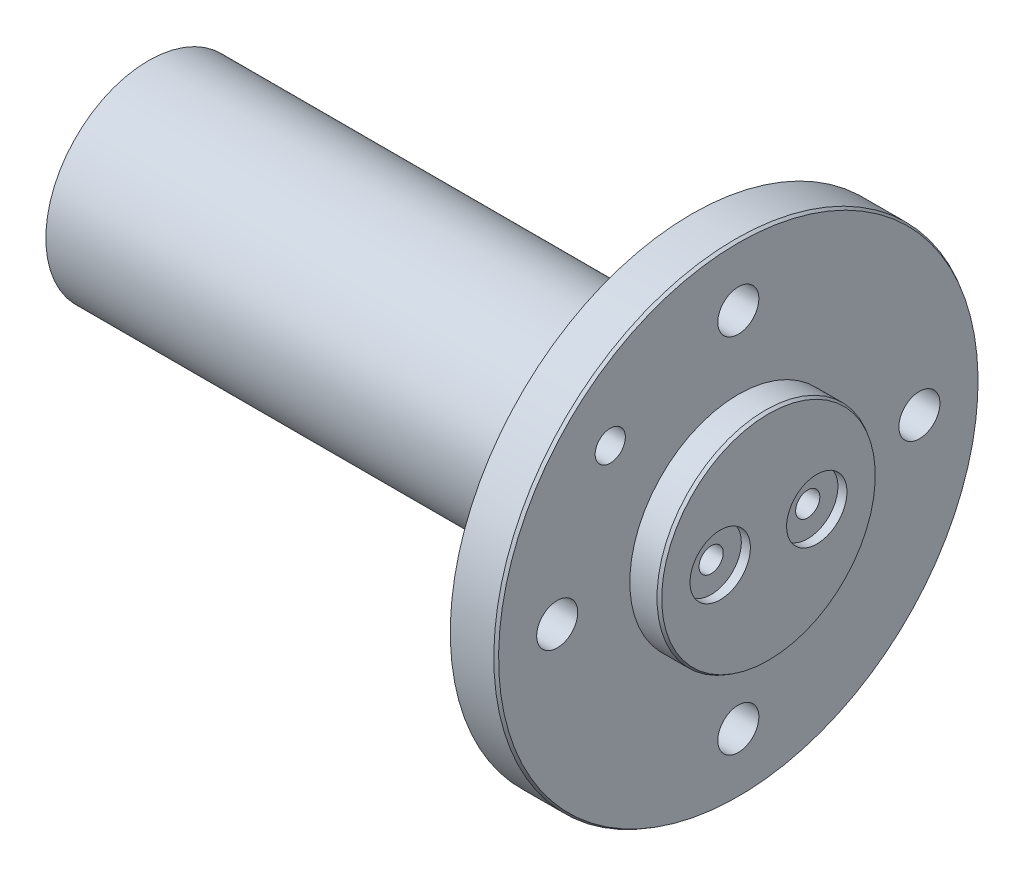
ISO-10303-21;
HEADER;
FILE_DESCRIPTION(('STEP AP214'),'2;1');
FILE_NAME('part.step','',(''),(''),'','','');
FILE_SCHEMA(('AUTOMOTIVE_DESIGN { 1 0 10303 214 1 1 1 1 }'));
ENDSEC;
DATA;
#1=APPLICATION_CONTEXT('core data for automotive mechanical design processes');
#2=APPLICATION_PROTOCOL_DEFINITION('international standard','automotive_design',2000,#1);
#3=PRODUCT_CONTEXT('',#1,'mechanical');
#4=PRODUCT('Part','Part','',(#3));
#5=PRODUCT_RELATED_PRODUCT_CATEGORY('part','',(#4));
#6=PRODUCT_DEFINITION_FORMATION('','',#4);
#7=PRODUCT_DEFINITION_CONTEXT('part definition',#1,'design');
#8=PRODUCT_DEFINITION('design','',#6,#7);
#9=PRODUCT_DEFINITION_SHAPE('','',#8);
#10=(LENGTH_UNIT() NAMED_UNIT(*) SI_UNIT(.MILLI.,.METRE.));
#11=(NAMED_UNIT(*) PLANE_ANGLE_UNIT() SI_UNIT($,.RADIAN.));
#12=(NAMED_UNIT(*) SI_UNIT($,.STERADIAN.) SOLID_ANGLE_UNIT());
#13=UNCERTAINTY_MEASURE_WITH_UNIT(LENGTH_MEASURE(1.E-05),#10,'distance_accuracy_value','');
#14=(GEOMETRIC_REPRESENTATION_CONTEXT(3) GLOBAL_UNCERTAINTY_ASSIGNED_CONTEXT((#13)) GLOBAL_UNIT_ASSIGNED_CONTEXT((#10,
#11,#12)) REPRESENTATION_CONTEXT('',''));
#15=CARTESIAN_POINT('',(0.,0.,0.));
#16=DIRECTION('',(0.,0.,1.));
#17=DIRECTION('',(1.,0.,0.));
#18=AXIS2_PLACEMENT_3D('',#15,#16,#17);
#19=CARTESIAN_POINT('',(0.,0.,0.));
#20=DIRECTION('',(1.,0.,0.));
#21=DIRECTION('',(0.,1.,0.));
#22=AXIS2_PLACEMENT_3D('',#19,#20,#21);
#23=PLANE('',#22);
#24=CARTESIAN_POINT('',(0.,0.,0.));
#25=DIRECTION('',(1.,0.,0.));
#26=DIRECTION('',(0.,1.,0.));
#27=AXIS2_PLACEMENT_3D('',#24,#25,#26);
#28=CIRCLE('',#27,17.6863248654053);
#29=CARTESIAN_POINT('',(0.,17.6863248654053,0.));
#30=VERTEX_POINT('',#29);
#31=EDGE_CURVE('E29',#30,#30,#28,.T.);
#32=ORIENTED_EDGE('',*,*,#31,.T.);
#33=EDGE_LOOP('',(#32));
#34=FACE_BOUND('',#33,.T.);
#35=CARTESIAN_POINT('',(0.,0.,8.));
#36=DIRECTION('',(1.,0.,0.));
#37=DIRECTION('',(0.,1.,0.));
#38=AXIS2_PLACEMENT_3D('',#35,#36,#37);
#39=CIRCLE('',#38,5.);
#40=CARTESIAN_POINT('',(0.,5.,8.));
#41=VERTEX_POINT('',#40);
#42=EDGE_CURVE('E84',#41,#41,#39,.T.);
#43=ORIENTED_EDGE('',*,*,#42,.F.);
#44=EDGE_LOOP('',(#43));
#45=FACE_BOUND('',#44,.T.);
#46=CARTESIAN_POINT('',(0.,0.,-8.));
#47=DIRECTION('',(1.,0.,0.));
#48=DIRECTION('',(0.,1.,0.));
#49=AXIS2_PLACEMENT_3D('',#46,#47,#48);
#50=CIRCLE('',#49,5.);
#51=CARTESIAN_POINT('',(0.,5.,-8.));
#52=VERTEX_POINT('',#51);
#53=EDGE_CURVE('E50',#52,#52,#50,.T.);
#54=ORIENTED_EDGE('',*,*,#53,.F.);
#55=EDGE_LOOP('',(#54));
#56=FACE_BOUND('',#55,.T.);
#57=ADVANCED_FACE('F14',(#34,#45,#56),#23,.T.);
#58=CARTESIAN_POINT('',(0.,0.,0.));
#59=DIRECTION('',(1.,0.,0.));
#60=DIRECTION('',(0.,1.,0.));
#61=AXIS2_PLACEMENT_3D('',#58,#59,#60);
#62=CYLINDRICAL_SURFACE('',#61,17.975);
#63=CARTESIAN_POINT('',(-0.499999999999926,0.,0.));
#64=DIRECTION('',(1.,0.,0.));
#65=DIRECTION('',(0.,1.,0.));
#66=AXIS2_PLACEMENT_3D('',#63,#64,#65);
#67=CIRCLE('',#66,17.975);
#68=CARTESIAN_POINT('',(-0.499999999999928,17.975,0.));
#69=VERTEX_POINT('',#68);
#70=EDGE_CURVE('E25',#69,#69,#67,.F.);
#71=ORIENTED_EDGE('',*,*,#70,.T.);
#72=EDGE_LOOP('',(#71));
#73=FACE_BOUND('',#72,.T.);
#74=CARTESIAN_POINT('',(-5.,0.,0.));
#75=DIRECTION('',(1.,0.,0.));
#76=DIRECTION('',(0.,1.,0.));
#77=AXIS2_PLACEMENT_3D('',#74,#75,#76);
#78=CIRCLE('',#77,17.975);
#79=CARTESIAN_POINT('',(-5.,17.975,0.));
#80=VERTEX_POINT('',#79);
#81=EDGE_CURVE('E46',#80,#80,#78,.T.);
#82=ORIENTED_EDGE('',*,*,#81,.T.);
#83=EDGE_LOOP('',(#82));
#84=FACE_BOUND('',#83,.T.);
#85=ADVANCED_FACE('F120',(#73,#84),#62,.T.);
#86=CARTESIAN_POINT('',(-5.,17.975,0.));
#87=DIRECTION('',(1.,0.,0.));
#88=DIRECTION('',(0.,1.,0.));
#89=AXIS2_PLACEMENT_3D('',#86,#87,#88);
#90=PLANE('',#89);
#91=CARTESIAN_POINT('',(-5.,0.,0.));
#92=DIRECTION('',(1.,0.,0.));
#93=DIRECTION('',(0.,1.,0.));
#94=AXIS2_PLACEMENT_3D('',#91,#92,#93);
#95=CIRCLE('',#94,39.7113248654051);
#96=CARTESIAN_POINT('',(-5.00000000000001,39.7113248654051,0.));
#97=VERTEX_POINT('',#96);
#98=EDGE_CURVE('E34',#97,#97,#95,.T.);
#99=ORIENTED_EDGE('',*,*,#98,.T.);
#100=EDGE_LOOP('',(#99));
#101=FACE_BOUND('',#100,.T.);
#102=CARTESIAN_POINT('',(-5.,21.2132034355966,21.2132034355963));
#103=DIRECTION('',(1.,0.,0.));
#104=DIRECTION('',(0.,1.,0.));
#105=AXIS2_PLACEMENT_3D('',#102,#103,#104);
#106=CIRCLE('',#105,2.5);
#107=CARTESIAN_POINT('',(-5.,23.7132034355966,21.2132034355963));
#108=VERTEX_POINT('',#107);
#109=EDGE_CURVE('E101',#108,#108,#106,.T.);
#110=ORIENTED_EDGE('',*,*,#109,.F.);
#111=EDGE_LOOP('',(#110));
#112=FACE_BOUND('',#111,.T.);
#113=CARTESIAN_POINT('',(-5.,30.,0.));
#114=DIRECTION('',(1.,0.,0.));
#115=DIRECTION('',(0.,1.,0.));
#116=AXIS2_PLACEMENT_3D('',#113,#114,#115);
#117=CIRCLE('',#116,3.4);
#118=CARTESIAN_POINT('',(-5.,33.4,0.));
#119=VERTEX_POINT('',#118);
#120=EDGE_CURVE('E60',#119,#119,#117,.T.);
#121=ORIENTED_EDGE('',*,*,#120,.F.);
#122=EDGE_LOOP('',(#121));
#123=FACE_BOUND('',#122,.T.);
#124=CARTESIAN_POINT('',(-5.,0.,30.));
#125=DIRECTION('',(1.,0.,0.));
#126=DIRECTION('',(0.,1.,0.));
#127=AXIS2_PLACEMENT_3D('',#124,#125,#126);
#128=CIRCLE('',#127,3.4);
#129=CARTESIAN_POINT('',(-5.,3.4,30.));
#130=VERTEX_POINT('',#129);
#131=EDGE_CURVE('E96',#130,#130,#128,.T.);
#132=ORIENTED_EDGE('',*,*,#131,.F.);
#133=EDGE_LOOP('',(#132));
#134=FACE_BOUND('',#133,.T.);
#135=CARTESIAN_POINT('',(-5.,-30.,0.));
#136=DIRECTION('',(1.,0.,0.));
#137=DIRECTION('',(0.,1.,0.));
#138=AXIS2_PLACEMENT_3D('',#135,#136,#137);
#139=CIRCLE('',#138,3.4);
#140=CARTESIAN_POINT('',(-5.,-26.6,0.));
#141=VERTEX_POINT('',#140);
#142=EDGE_CURVE('E92',#141,#141,#139,.T.);
#143=ORIENTED_EDGE('',*,*,#142,.F.);
#144=EDGE_LOOP('',(#143));
#145=FACE_BOUND('',#144,.T.);
#146=CARTESIAN_POINT('',(-5.,0.,-30.));
#147=DIRECTION('',(1.,0.,0.));
#148=DIRECTION('',(0.,1.,0.));
#149=AXIS2_PLACEMENT_3D('',#146,#147,#148);
#150=CIRCLE('',#149,3.4);
#151=CARTESIAN_POINT('',(-5.,3.4,-30.));
#152=VERTEX_POINT('',#151);
#153=EDGE_CURVE('E89',#152,#152,#150,.T.);
#154=ORIENTED_EDGE('',*,*,#153,.F.);
#155=EDGE_LOOP('',(#154));
#156=FACE_BOUND('',#155,.T.);
#157=ORIENTED_EDGE('',*,*,#81,.F.);
#158=EDGE_LOOP('',(#157));
#159=FACE_BOUND('',#158,.T.);
#160=ADVANCED_FACE('F116',(#101,#112,#123,#134,#145,#156,#159),#90,.T.);
#161=CARTESIAN_POINT('',(0.,0.,0.));
#162=DIRECTION('',(1.,0.,0.));
#163=DIRECTION('',(0.,1.,0.));
#164=AXIS2_PLACEMENT_3D('',#161,#162,#163);
#165=CYLINDRICAL_SURFACE('',#164,40.);
#166=CARTESIAN_POINT('',(-12.7113248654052,0.,0.));
#167=DIRECTION('',(-1.,0.,0.));
#168=DIRECTION('',(0.,-1.,0.));
#169=AXIS2_PLACEMENT_3D('',#166,#167,#168);
#170=CIRCLE('',#169,40.);
#171=CARTESIAN_POINT('',(-12.7113248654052,-40.,0.));
#172=VERTEX_POINT('',#171);
#173=EDGE_CURVE('E40',#172,#172,#170,.F.);
#174=ORIENTED_EDGE('',*,*,#173,.T.);
#175=EDGE_LOOP('',(#174));
#176=FACE_BOUND('',#175,.T.);
#177=CARTESIAN_POINT('',(-5.5,0.,0.));
#178=DIRECTION('',(1.,0.,0.));
#179=DIRECTION('',(0.,1.,0.));
#180=AXIS2_PLACEMENT_3D('',#177,#178,#179);
#181=CIRCLE('',#180,40.);
#182=CARTESIAN_POINT('',(-5.50000000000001,40.,0.));
#183=VERTEX_POINT('',#182);
#184=EDGE_CURVE('E43',#183,#183,#181,.F.);
#185=ORIENTED_EDGE('',*,*,#184,.T.);
#186=EDGE_LOOP('',(#185));
#187=FACE_BOUND('',#186,.T.);
#188=ADVANCED_FACE('F119',(#176,#187),#165,.T.);
#189=CARTESIAN_POINT('',(-13.,40.,0.));
#190=DIRECTION('',(-1.,0.,0.));
#191=DIRECTION('',(0.,-1.,0.));
#192=AXIS2_PLACEMENT_3D('',#189,#190,#191);
#193=PLANE('',#192);
#194=CARTESIAN_POINT('',(-13.,0.,0.));
#195=DIRECTION('',(-1.,0.,0.));
#196=DIRECTION('',(0.,-1.,0.));
#197=AXIS2_PLACEMENT_3D('',#194,#195,#196);
#198=CIRCLE('',#197,39.5);
#199=CARTESIAN_POINT('',(-13.,-39.5,0.));
#200=VERTEX_POINT('',#199);
#201=EDGE_CURVE('E37',#200,#200,#198,.T.);
#202=ORIENTED_EDGE('',*,*,#201,.T.);
#203=EDGE_LOOP('',(#202));
#204=FACE_BOUND('',#203,.T.);
#205=CARTESIAN_POINT('',(-13.,30.,0.));
#206=DIRECTION('',(-1.,0.,0.));
#207=DIRECTION('',(0.,-1.,0.));
#208=AXIS2_PLACEMENT_3D('',#205,#206,#207);
#209=CIRCLE('',#208,3.4);
#210=CARTESIAN_POINT('',(-13.,26.6,0.));
#211=VERTEX_POINT('',#210);
#212=EDGE_CURVE('E47',#211,#211,#209,.T.);
#213=ORIENTED_EDGE('',*,*,#212,.F.);
#214=EDGE_LOOP('',(#213));
#215=FACE_BOUND('',#214,.T.);
#216=CARTESIAN_POINT('',(-13.,0.,30.));
#217=DIRECTION('',(-1.,0.,0.));
#218=DIRECTION('',(0.,-1.,0.));
#219=AXIS2_PLACEMENT_3D('',#216,#217,#218);
#220=CIRCLE('',#219,3.4);
#221=CARTESIAN_POINT('',(-13.,-3.4,30.));
#222=VERTEX_POINT('',#221);
#223=EDGE_CURVE('E51',#222,#222,#220,.T.);
#224=ORIENTED_EDGE('',*,*,#223,.F.);
#225=EDGE_LOOP('',(#224));
#226=FACE_BOUND('',#225,.T.);
#227=CARTESIAN_POINT('',(-13.,-30.,0.));
#228=DIRECTION('',(-1.,0.,0.));
#229=DIRECTION('',(0.,-1.,0.));
#230=AXIS2_PLACEMENT_3D('',#227,#228,#229);
#231=CIRCLE('',#230,3.4);
#232=CARTESIAN_POINT('',(-13.,-33.4,0.));
#233=VERTEX_POINT('',#232);
#234=EDGE_CURVE('E54',#233,#233,#231,.T.);
#235=ORIENTED_EDGE('',*,*,#234,.F.);
#236=EDGE_LOOP('',(#235));
#237=FACE_BOUND('',#236,.T.);
#238=CARTESIAN_POINT('',(-13.,0.,-30.));
#239=DIRECTION('',(-1.,0.,0.));
#240=DIRECTION('',(0.,-1.,0.));
#241=AXIS2_PLACEMENT_3D('',#238,#239,#240);
#242=CIRCLE('',#241,3.4);
#243=CARTESIAN_POINT('',(-13.,-3.4,-30.));
#244=VERTEX_POINT('',#243);
#245=EDGE_CURVE('E57',#244,#244,#242,.T.);
#246=ORIENTED_EDGE('',*,*,#245,.F.);
#247=EDGE_LOOP('',(#246));
#248=FACE_BOUND('',#247,.T.);
#249=CARTESIAN_POINT('',(-13.,0.,0.));
#250=DIRECTION('',(1.,0.,0.));
#251=DIRECTION('',(0.,1.,0.));
#252=AXIS2_PLACEMENT_3D('',#249,#250,#251);
#253=CIRCLE('',#252,17.);
#254=CARTESIAN_POINT('',(-13.,17.,0.));
#255=VERTEX_POINT('',#254);
#256=EDGE_CURVE('E71',#255,#255,#253,.T.);
#257=ORIENTED_EDGE('',*,*,#256,.T.);
#258=EDGE_LOOP('',(#257));
#259=FACE_BOUND('',#258,.T.);
#260=ADVANCED_FACE('F207',(#204,#215,#226,#237,#248,#259),#193,.T.);
#261=CARTESIAN_POINT('',(0.,0.,0.));
#262=DIRECTION('',(1.,0.,0.));
#263=DIRECTION('',(0.,1.,0.));
#264=AXIS2_PLACEMENT_3D('',#261,#262,#263);
#265=CYLINDRICAL_SURFACE('',#264,17.);
#266=CARTESIAN_POINT('',(-102.711324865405,0.,0.));
#267=DIRECTION('',(-1.,0.,0.));
#268=DIRECTION('',(0.,-1.,0.));
#269=AXIS2_PLACEMENT_3D('',#266,#267,#268);
#270=CIRCLE('',#269,17.);
#271=CARTESIAN_POINT('',(-102.711324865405,-17.,0.));
#272=VERTEX_POINT('',#271);
#273=EDGE_CURVE('E21',#272,#272,#270,.F.);
#274=ORIENTED_EDGE('',*,*,#273,.T.);
#275=EDGE_LOOP('',(#274));
#276=FACE_BOUND('',#275,.T.);
#277=ORIENTED_EDGE('',*,*,#256,.F.);
#278=EDGE_LOOP('',(#277));
#279=FACE_BOUND('',#278,.T.);
#280=ADVANCED_FACE('F204',(#276,#279),#265,.T.);
#281=CARTESIAN_POINT('',(-103.,17.,0.));
#282=DIRECTION('',(-1.,0.,0.));
#283=DIRECTION('',(0.,-1.,0.));
#284=AXIS2_PLACEMENT_3D('',#281,#282,#283);
#285=PLANE('',#284);
#286=CARTESIAN_POINT('',(-103.,0.,0.));
#287=DIRECTION('',(-1.,0.,0.));
#288=DIRECTION('',(0.,-1.,0.));
#289=AXIS2_PLACEMENT_3D('',#286,#287,#288);
#290=CIRCLE('',#289,16.5);
#291=CARTESIAN_POINT('',(-103.,-16.5,0.));
#292=VERTEX_POINT('',#291);
#293=EDGE_CURVE('E9',#292,#292,#290,.T.);
#294=ORIENTED_EDGE('',*,*,#293,.T.);
#295=EDGE_LOOP('',(#294));
#296=FACE_BOUND('',#295,.T.);
#297=ADVANCED_FACE('F200',(#296),#285,.T.);
#298=CARTESIAN_POINT('',(-1.5,0.,8.));
#299=DIRECTION('',(1.,0.,0.));
#300=DIRECTION('',(0.,1.,0.));
#301=AXIS2_PLACEMENT_3D('',#298,#299,#300);
#302=PLANE('',#301);
#303=CARTESIAN_POINT('',(-1.5,0.,8.));
#304=DIRECTION('',(1.,0.,0.));
#305=DIRECTION('',(0.,1.,0.));
#306=AXIS2_PLACEMENT_3D('',#303,#304,#305);
#307=CIRCLE('',#306,5.);
#308=CARTESIAN_POINT('',(-1.5,5.,8.));
#309=VERTEX_POINT('',#308);
#310=EDGE_CURVE('E68',#309,#309,#307,.T.);
#311=ORIENTED_EDGE('',*,*,#310,.T.);
#312=EDGE_LOOP('',(#311));
#313=FACE_BOUND('',#312,.T.);
#314=CARTESIAN_POINT('',(-1.5,0.,8.));
#315=DIRECTION('',(1.,0.,0.));
#316=DIRECTION('',(0.,1.,0.));
#317=AXIS2_PLACEMENT_3D('',#314,#315,#316);
#318=CIRCLE('',#317,2.);
#319=CARTESIAN_POINT('',(-1.5,2.,8.));
#320=VERTEX_POINT('',#319);
#321=EDGE_CURVE('E65',#320,#320,#318,.F.);
#322=ORIENTED_EDGE('',*,*,#321,.T.);
#323=EDGE_LOOP('',(#322));
#324=FACE_BOUND('',#323,.T.);
#325=ADVANCED_FACE('F203',(#313,#324),#302,.T.);
#326=CARTESIAN_POINT('',(-1.5,0.,8.));
#327=DIRECTION('',(1.,0.,0.));
#328=DIRECTION('',(0.,1.,0.));
#329=AXIS2_PLACEMENT_3D('',#326,#327,#328);
#330=CYLINDRICAL_SURFACE('',#329,5.);
#331=ORIENTED_EDGE('',*,*,#310,.F.);
#332=EDGE_LOOP('',(#331));
#333=FACE_BOUND('',#332,.T.);
#334=ORIENTED_EDGE('',*,*,#42,.T.);
#335=EDGE_LOOP('',(#334));
#336=FACE_BOUND('',#335,.T.);
#337=ADVANCED_FACE('F182',(#333,#336),#330,.F.);
#338=CARTESIAN_POINT('',(-1.5,0.,-8.));
#339=DIRECTION('',(1.,0.,0.));
#340=DIRECTION('',(0.,1.,0.));
#341=AXIS2_PLACEMENT_3D('',#338,#339,#340);
#342=PLANE('',#341);
#343=CARTESIAN_POINT('',(-1.5,0.,-8.));
#344=DIRECTION('',(1.,0.,0.));
#345=DIRECTION('',(0.,1.,0.));
#346=AXIS2_PLACEMENT_3D('',#343,#344,#345);
#347=CIRCLE('',#346,5.);
#348=CARTESIAN_POINT('',(-1.5,5.,-8.));
#349=VERTEX_POINT('',#348);
#350=EDGE_CURVE('E81',#349,#349,#347,.T.);
#351=ORIENTED_EDGE('',*,*,#350,.T.);
#352=EDGE_LOOP('',(#351));
#353=FACE_BOUND('',#352,.T.);
#354=CARTESIAN_POINT('',(-1.5,0.,-8.));
#355=DIRECTION('',(1.,0.,0.));
#356=DIRECTION('',(0.,1.,0.));
#357=AXIS2_PLACEMENT_3D('',#354,#355,#356);
#358=CIRCLE('',#357,2.);
#359=CARTESIAN_POINT('',(-1.5,2.,-8.));
#360=VERTEX_POINT('',#359);
#361=EDGE_CURVE('E61',#360,#360,#358,.F.);
#362=ORIENTED_EDGE('',*,*,#361,.T.);
#363=EDGE_LOOP('',(#362));
#364=FACE_BOUND('',#363,.T.);
#365=ADVANCED_FACE('F171',(#353,#364),#342,.T.);
#366=CARTESIAN_POINT('',(-1.5,0.,-8.));
#367=DIRECTION('',(1.,0.,0.));
#368=DIRECTION('',(0.,1.,0.));
#369=AXIS2_PLACEMENT_3D('',#366,#367,#368);
#370=CYLINDRICAL_SURFACE('',#369,5.);
#371=ORIENTED_EDGE('',*,*,#350,.F.);
#372=EDGE_LOOP('',(#371));
#373=FACE_BOUND('',#372,.T.);
#374=ORIENTED_EDGE('',*,*,#53,.T.);
#375=EDGE_LOOP('',(#374));
#376=FACE_BOUND('',#375,.T.);
#377=ADVANCED_FACE('F168',(#373,#376),#370,.F.);
#378=CARTESIAN_POINT('',(-85.,0.,8.));
#379=DIRECTION('',(1.,0.,0.));
#380=DIRECTION('',(0.,1.,0.));
#381=AXIS2_PLACEMENT_3D('',#378,#379,#380);
#382=PLANE('',#381);
#383=CARTESIAN_POINT('',(-85.,0.,8.));
#384=DIRECTION('',(1.,0.,0.));
#385=DIRECTION('',(0.,1.,0.));
#386=AXIS2_PLACEMENT_3D('',#383,#384,#385);
#387=CIRCLE('',#386,2.);
#388=CARTESIAN_POINT('',(-85.,1.99999999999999,8.));
#389=VERTEX_POINT('',#388);
#390=EDGE_CURVE('E74',#389,#389,#387,.T.);
#391=ORIENTED_EDGE('',*,*,#390,.T.);
#392=EDGE_LOOP('',(#391));
#393=FACE_BOUND('',#392,.T.);
#394=ADVANCED_FACE('F170',(#393),#382,.T.);
#395=CARTESIAN_POINT('',(-85.,0.,8.));
#396=DIRECTION('',(1.,0.,0.));
#397=DIRECTION('',(0.,1.,0.));
#398=AXIS2_PLACEMENT_3D('',#395,#396,#397);
#399=CYLINDRICAL_SURFACE('',#398,2.);
#400=ORIENTED_EDGE('',*,*,#390,.F.);
#401=EDGE_LOOP('',(#400));
#402=FACE_BOUND('',#401,.T.);
#403=ORIENTED_EDGE('',*,*,#321,.F.);
#404=EDGE_LOOP('',(#403));
#405=FACE_BOUND('',#404,.T.);
#406=ADVANCED_FACE('F179',(#402,#405),#399,.F.);
#407=CARTESIAN_POINT('',(-85.,0.,-8.));
#408=DIRECTION('',(1.,0.,0.));
#409=DIRECTION('',(0.,1.,0.));
#410=AXIS2_PLACEMENT_3D('',#407,#408,#409);
#411=PLANE('',#410);
#412=CARTESIAN_POINT('',(-85.,0.,-8.));
#413=DIRECTION('',(1.,0.,0.));
#414=DIRECTION('',(0.,1.,0.));
#415=AXIS2_PLACEMENT_3D('',#412,#413,#414);
#416=CIRCLE('',#415,2.);
#417=CARTESIAN_POINT('',(-85.,1.99999999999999,-8.));
#418=VERTEX_POINT('',#417);
#419=EDGE_CURVE('E64',#418,#418,#416,.T.);
#420=ORIENTED_EDGE('',*,*,#419,.T.);
#421=EDGE_LOOP('',(#420));
#422=FACE_BOUND('',#421,.T.);
#423=ADVANCED_FACE('F190',(#422),#411,.T.);
#424=CARTESIAN_POINT('',(-85.,0.,-8.));
#425=DIRECTION('',(1.,0.,0.));
#426=DIRECTION('',(0.,1.,0.));
#427=AXIS2_PLACEMENT_3D('',#424,#425,#426);
#428=CYLINDRICAL_SURFACE('',#427,2.);
#429=ORIENTED_EDGE('',*,*,#419,.F.);
#430=EDGE_LOOP('',(#429));
#431=FACE_BOUND('',#430,.T.);
#432=ORIENTED_EDGE('',*,*,#361,.F.);
#433=EDGE_LOOP('',(#432));
#434=FACE_BOUND('',#433,.T.);
#435=ADVANCED_FACE('F194',(#431,#434),#428,.F.);
#436=CARTESIAN_POINT('',(-103.,0.,-30.));
#437=DIRECTION('',(1.,0.,0.));
#438=DIRECTION('',(0.,1.,0.));
#439=AXIS2_PLACEMENT_3D('',#436,#437,#438);
#440=CYLINDRICAL_SURFACE('',#439,3.4);
#441=ORIENTED_EDGE('',*,*,#245,.T.);
#442=EDGE_LOOP('',(#441));
#443=FACE_BOUND('',#442,.T.);
#444=ORIENTED_EDGE('',*,*,#153,.T.);
#445=EDGE_LOOP('',(#444));
#446=FACE_BOUND('',#445,.T.);
#447=ADVANCED_FACE('F198',(#443,#446),#440,.F.);
#448=CARTESIAN_POINT('',(-103.,-30.,0.));
#449=DIRECTION('',(1.,0.,0.));
#450=DIRECTION('',(0.,1.,0.));
#451=AXIS2_PLACEMENT_3D('',#448,#449,#450);
#452=CYLINDRICAL_SURFACE('',#451,3.4);
#453=ORIENTED_EDGE('',*,*,#234,.T.);
#454=EDGE_LOOP('',(#453));
#455=FACE_BOUND('',#454,.T.);
#456=ORIENTED_EDGE('',*,*,#142,.T.);
#457=EDGE_LOOP('',(#456));
#458=FACE_BOUND('',#457,.T.);
#459=ADVANCED_FACE('F300',(#455,#458),#452,.F.);
#460=CARTESIAN_POINT('',(-103.,0.,30.));
#461=DIRECTION('',(1.,0.,0.));
#462=DIRECTION('',(0.,1.,0.));
#463=AXIS2_PLACEMENT_3D('',#460,#461,#462);
#464=CYLINDRICAL_SURFACE('',#463,3.4);
#465=ORIENTED_EDGE('',*,*,#223,.T.);
#466=EDGE_LOOP('',(#465));
#467=FACE_BOUND('',#466,.T.);
#468=ORIENTED_EDGE('',*,*,#131,.T.);
#469=EDGE_LOOP('',(#468));
#470=FACE_BOUND('',#469,.T.);
#471=ADVANCED_FACE('F310',(#467,#470),#464,.F.);
#472=CARTESIAN_POINT('',(-103.,30.,0.));
#473=DIRECTION('',(1.,0.,0.));
#474=DIRECTION('',(0.,1.,0.));
#475=AXIS2_PLACEMENT_3D('',#472,#473,#474);
#476=CYLINDRICAL_SURFACE('',#475,3.4);
#477=ORIENTED_EDGE('',*,*,#212,.T.);
#478=EDGE_LOOP('',(#477));
#479=FACE_BOUND('',#478,.T.);
#480=ORIENTED_EDGE('',*,*,#120,.T.);
#481=EDGE_LOOP('',(#480));
#482=FACE_BOUND('',#481,.T.);
#483=ADVANCED_FACE('F112',(#479,#482),#476,.F.);
#484=CARTESIAN_POINT('',(-12.,21.2132034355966,21.2132034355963));
#485=DIRECTION('',(1.,0.,0.));
#486=DIRECTION('',(0.,1.,0.));
#487=AXIS2_PLACEMENT_3D('',#484,#485,#486);
#488=CYLINDRICAL_SURFACE('',#487,2.5);
#489=CARTESIAN_POINT('',(-12.,21.2132034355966,21.2132034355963));
#490=DIRECTION('',(1.,0.,0.));
#491=DIRECTION('',(0.,1.,0.));
#492=AXIS2_PLACEMENT_3D('',#489,#490,#491);
#493=CIRCLE('',#492,2.5);
#494=CARTESIAN_POINT('',(-12.,23.7132034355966,21.2132034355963));
#495=VERTEX_POINT('',#494);
#496=EDGE_CURVE('E93',#495,#495,#493,.T.);
#497=ORIENTED_EDGE('',*,*,#496,.F.);
#498=EDGE_LOOP('',(#497));
#499=FACE_BOUND('',#498,.T.);
#500=ORIENTED_EDGE('',*,*,#109,.T.);
#501=EDGE_LOOP('',(#500));
#502=FACE_BOUND('',#501,.T.);
#503=ADVANCED_FACE('F109',(#499,#502),#488,.F.);
#504=CARTESIAN_POINT('',(-12.,21.2132034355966,21.2132034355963));
#505=DIRECTION('',(1.,0.,0.));
#506=DIRECTION('',(0.,1.,0.));
#507=AXIS2_PLACEMENT_3D('',#504,#505,#506);
#508=PLANE('',#507);
#509=ORIENTED_EDGE('',*,*,#496,.T.);
#510=EDGE_LOOP('',(#509));
#511=FACE_BOUND('',#510,.T.);
#512=ADVANCED_FACE('F107',(#511),#508,.T.);
#513=CARTESIAN_POINT('',(-12.7113248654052,0.,0.));
#514=DIRECTION('',(1.,0.,0.));
#515=DIRECTION('',(0.,1.,0.));
#516=AXIS2_PLACEMENT_3D('',#513,#514,#515);
#517=CONICAL_SURFACE('',#516,40.,1.04719755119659);
#518=ORIENTED_EDGE('',*,*,#201,.F.);
#519=EDGE_LOOP('',(#518));
#520=FACE_BOUND('',#519,.T.);
#521=ORIENTED_EDGE('',*,*,#173,.F.);
#522=EDGE_LOOP('',(#521));
#523=FACE_BOUND('',#522,.T.);
#524=ADVANCED_FACE('F145',(#520,#523),#517,.T.);
#525=CARTESIAN_POINT('',(-5.,0.,0.));
#526=DIRECTION('',(-1.,0.,0.));
#527=DIRECTION('',(0.,-1.,0.));
#528=AXIS2_PLACEMENT_3D('',#525,#526,#527);
#529=CONICAL_SURFACE('',#528,39.7113248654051,0.523598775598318);
#530=ORIENTED_EDGE('',*,*,#184,.F.);
#531=EDGE_LOOP('',(#530));
#532=FACE_BOUND('',#531,.T.);
#533=ORIENTED_EDGE('',*,*,#98,.F.);
#534=EDGE_LOOP('',(#533));
#535=FACE_BOUND('',#534,.T.);
#536=ADVANCED_FACE('F148',(#532,#535),#529,.T.);
#537=CARTESIAN_POINT('',(0.,0.,0.));
#538=DIRECTION('',(-1.,0.,0.));
#539=DIRECTION('',(0.,-1.,0.));
#540=AXIS2_PLACEMENT_3D('',#537,#538,#539);
#541=CONICAL_SURFACE('',#540,17.6863248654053,0.523598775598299);
#542=ORIENTED_EDGE('',*,*,#70,.F.);
#543=EDGE_LOOP('',(#542));
#544=FACE_BOUND('',#543,.T.);
#545=ORIENTED_EDGE('',*,*,#31,.F.);
#546=EDGE_LOOP('',(#545));
#547=FACE_BOUND('',#546,.T.);
#548=ADVANCED_FACE('F151',(#544,#547),#541,.T.);
#549=CARTESIAN_POINT('',(-102.711324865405,0.,0.));
#550=DIRECTION('',(1.,0.,0.));
#551=DIRECTION('',(0.,1.,0.));
#552=AXIS2_PLACEMENT_3D('',#549,#550,#551);
#553=CONICAL_SURFACE('',#552,17.,1.04719755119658);
#554=ORIENTED_EDGE('',*,*,#293,.F.);
#555=EDGE_LOOP('',(#554));
#556=FACE_BOUND('',#555,.T.);
#557=ORIENTED_EDGE('',*,*,#273,.F.);
#558=EDGE_LOOP('',(#557));
#559=FACE_BOUND('',#558,.T.);
#560=ADVANCED_FACE('F16',(#556,#559),#553,.T.);
#561=CLOSED_SHELL('',(#57,#85,#160,#188,#260,#280,#297,#325,#337,#365,#377,#394,#406,#423,#435,
#447,#459,#471,#483,#503,#512,#524,#536,#548,#560));
#562=MANIFOLD_SOLID_BREP('B1',#561);
#563=ADVANCED_BREP_SHAPE_REPRESENTATION('',(#18,#562),#14);
#564=SHAPE_DEFINITION_REPRESENTATION(#9,#563);
ENDSEC;
END-ISO-10303-21;
